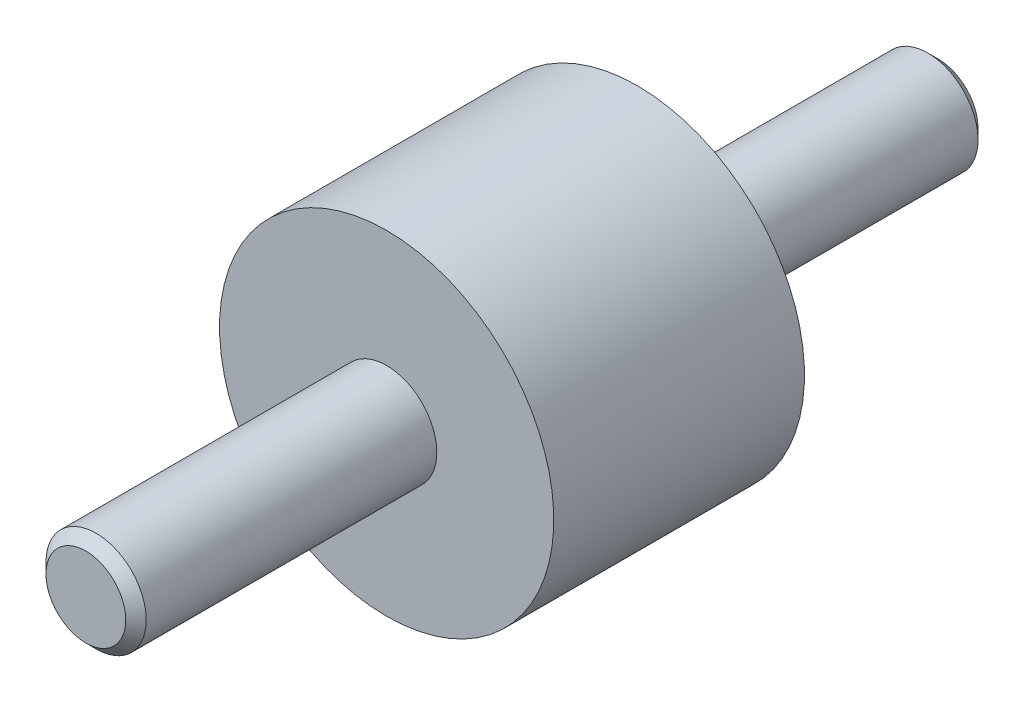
ISO-10303-21;
HEADER;
FILE_DESCRIPTION(('STEP AP214'),'2;1');
FILE_NAME('part.step','',(''),(''),'','','');
FILE_SCHEMA(('AUTOMOTIVE_DESIGN { 1 0 10303 214 1 1 1 1 }'));
ENDSEC;
DATA;
#1=APPLICATION_CONTEXT('core data for automotive mechanical design processes');
#2=APPLICATION_PROTOCOL_DEFINITION('international standard','automotive_design',2000,#1);
#3=PRODUCT_CONTEXT('',#1,'mechanical');
#4=PRODUCT('Part','Part','',(#3));
#5=PRODUCT_RELATED_PRODUCT_CATEGORY('part','',(#4));
#6=PRODUCT_DEFINITION_FORMATION('','',#4);
#7=PRODUCT_DEFINITION_CONTEXT('part definition',#1,'design');
#8=PRODUCT_DEFINITION('design','',#6,#7);
#9=PRODUCT_DEFINITION_SHAPE('','',#8);
#10=(LENGTH_UNIT() NAMED_UNIT(*) SI_UNIT(.MILLI.,.METRE.));
#11=(NAMED_UNIT(*) PLANE_ANGLE_UNIT() SI_UNIT($,.RADIAN.));
#12=(NAMED_UNIT(*) SI_UNIT($,.STERADIAN.) SOLID_ANGLE_UNIT());
#13=UNCERTAINTY_MEASURE_WITH_UNIT(LENGTH_MEASURE(1.E-05),#10,'distance_accuracy_value','');
#14=(GEOMETRIC_REPRESENTATION_CONTEXT(3) GLOBAL_UNCERTAINTY_ASSIGNED_CONTEXT((#13)) GLOBAL_UNIT_ASSIGNED_CONTEXT((#10,
#11,#12)) REPRESENTATION_CONTEXT('',''));
#15=CARTESIAN_POINT('',(0.,0.,0.));
#16=DIRECTION('',(0.,0.,1.));
#17=DIRECTION('',(1.,0.,0.));
#18=AXIS2_PLACEMENT_3D('',#15,#16,#17);
#19=CARTESIAN_POINT('',(9.3333333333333,0.,15.));
#20=DIRECTION('',(0.,0.,1.));
#21=DIRECTION('',(0.,-1.,0.));
#22=AXIS2_PLACEMENT_3D('',#19,#20,#21);
#23=PLANE('',#22);
#24=CARTESIAN_POINT('',(0.,0.,15.));
#25=DIRECTION('',(0.,0.,1.));
#26=DIRECTION('',(0.,-1.,0.));
#27=AXIS2_PLACEMENT_3D('',#24,#25,#26);
#28=CIRCLE('',#27,3.);
#29=CARTESIAN_POINT('',(0.,-3.,15.));
#30=VERTEX_POINT('',#29);
#31=EDGE_CURVE('E8',#30,#30,#28,.T.);
#32=ORIENTED_EDGE('',*,*,#31,.F.);
#33=EDGE_LOOP('',(#32));
#34=FACE_BOUND('',#33,.T.);
#35=CARTESIAN_POINT('',(0.,0.,15.));
#36=DIRECTION('',(0.,0.,1.));
#37=DIRECTION('',(0.,-1.,0.));
#38=AXIS2_PLACEMENT_3D('',#35,#36,#37);
#39=CIRCLE('',#38,10.);
#40=CARTESIAN_POINT('',(0.,-10.,15.));
#41=VERTEX_POINT('',#40);
#42=EDGE_CURVE('E22',#41,#41,#39,.T.);
#43=ORIENTED_EDGE('',*,*,#42,.T.);
#44=EDGE_LOOP('',(#43));
#45=FACE_BOUND('',#44,.T.);
#46=ADVANCED_FACE('F12',(#34,#45),#23,.T.);
#47=CARTESIAN_POINT('',(0.,0.,0.5));
#48=DIRECTION('',(0.,0.,1.));
#49=DIRECTION('',(0.,-1.,0.));
#50=AXIS2_PLACEMENT_3D('',#47,#48,#49);
#51=CYLINDRICAL_SURFACE('',#50,10.);
#52=CARTESIAN_POINT('',(0.,0.,0.));
#53=DIRECTION('',(0.,0.,1.));
#54=DIRECTION('',(0.,-1.,0.));
#55=AXIS2_PLACEMENT_3D('',#52,#53,#54);
#56=CIRCLE('',#55,10.);
#57=CARTESIAN_POINT('',(0.,-10.,0.));
#58=VERTEX_POINT('',#57);
#59=EDGE_CURVE('E26',#58,#58,#56,.T.);
#60=ORIENTED_EDGE('',*,*,#59,.T.);
#61=EDGE_LOOP('',(#60));
#62=FACE_BOUND('',#61,.T.);
#63=ORIENTED_EDGE('',*,*,#42,.F.);
#64=EDGE_LOOP('',(#63));
#65=FACE_BOUND('',#64,.T.);
#66=ADVANCED_FACE('F57',(#62,#65),#51,.T.);
#67=CARTESIAN_POINT('',(10.,0.,0.));
#68=DIRECTION('',(0.,0.,-1.));
#69=DIRECTION('',(0.,1.,0.));
#70=AXIS2_PLACEMENT_3D('',#67,#68,#69);
#71=PLANE('',#70);
#72=CARTESIAN_POINT('',(0.,0.,0.));
#73=DIRECTION('',(0.,0.,-1.));
#74=DIRECTION('',(0.,1.,0.));
#75=AXIS2_PLACEMENT_3D('',#72,#73,#74);
#76=CIRCLE('',#75,3.);
#77=CARTESIAN_POINT('',(0.,3.,0.));
#78=VERTEX_POINT('',#77);
#79=EDGE_CURVE('E18',#78,#78,#76,.T.);
#80=ORIENTED_EDGE('',*,*,#79,.F.);
#81=EDGE_LOOP('',(#80));
#82=FACE_BOUND('',#81,.T.);
#83=ORIENTED_EDGE('',*,*,#59,.F.);
#84=EDGE_LOOP('',(#83));
#85=FACE_BOUND('',#84,.T.);
#86=ADVANCED_FACE('F62',(#82,#85),#71,.T.);
#87=CARTESIAN_POINT('',(0.,0.,-18.));
#88=DIRECTION('',(0.,0.,1.));
#89=DIRECTION('',(0.,-1.,0.));
#90=AXIS2_PLACEMENT_3D('',#87,#88,#89);
#91=CYLINDRICAL_SURFACE('',#90,3.);
#92=CARTESIAN_POINT('',(0.,0.,-17.3865));
#93=DIRECTION('',(0.,0.,1.));
#94=DIRECTION('',(0.,-1.,0.));
#95=AXIS2_PLACEMENT_3D('',#92,#93,#94);
#96=CIRCLE('',#95,3.);
#97=CARTESIAN_POINT('',(0.,-3.,-17.3865));
#98=VERTEX_POINT('',#97);
#99=EDGE_CURVE('E31',#98,#98,#96,.T.);
#100=ORIENTED_EDGE('',*,*,#99,.T.);
#101=EDGE_LOOP('',(#100));
#102=FACE_BOUND('',#101,.T.);
#103=ORIENTED_EDGE('',*,*,#79,.T.);
#104=EDGE_LOOP('',(#103));
#105=FACE_BOUND('',#104,.T.);
#106=ADVANCED_FACE('F70',(#102,#105),#91,.T.);
#107=CARTESIAN_POINT('',(0.,0.,-17.3865));
#108=DIRECTION('',(0.,0.,1.));
#109=DIRECTION('',(0.,-1.,0.));
#110=AXIS2_PLACEMENT_3D('',#107,#108,#109);
#111=CONICAL_SURFACE('',#110,3.,0.785398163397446);
#112=CARTESIAN_POINT('',(0.,0.,-18.));
#113=DIRECTION('',(0.,0.,1.));
#114=DIRECTION('',(0.,-1.,0.));
#115=AXIS2_PLACEMENT_3D('',#112,#113,#114);
#116=CIRCLE('',#115,2.3865);
#117=CARTESIAN_POINT('',(0.,-2.3865,-18.));
#118=VERTEX_POINT('',#117);
#119=EDGE_CURVE('E34',#118,#118,#116,.T.);
#120=ORIENTED_EDGE('',*,*,#119,.T.);
#121=EDGE_LOOP('',(#120));
#122=FACE_BOUND('',#121,.T.);
#123=ORIENTED_EDGE('',*,*,#99,.F.);
#124=EDGE_LOOP('',(#123));
#125=FACE_BOUND('',#124,.T.);
#126=ADVANCED_FACE('F76',(#122,#125),#111,.T.);
#127=CARTESIAN_POINT('',(2.3865,0.,-18.));
#128=DIRECTION('',(0.,0.,-1.));
#129=DIRECTION('',(0.,1.,0.));
#130=AXIS2_PLACEMENT_3D('',#127,#128,#129);
#131=PLANE('',#130);
#132=ORIENTED_EDGE('',*,*,#119,.F.);
#133=EDGE_LOOP('',(#132));
#134=FACE_BOUND('',#133,.T.);
#135=ADVANCED_FACE('F80',(#134),#131,.T.);
#136=CARTESIAN_POINT('',(0.,0.,33.));
#137=DIRECTION('',(0.,0.,1.));
#138=DIRECTION('',(0.,-1.,0.));
#139=AXIS2_PLACEMENT_3D('',#136,#137,#138);
#140=PLANE('',#139);
#141=CARTESIAN_POINT('',(0.,0.,33.));
#142=DIRECTION('',(0.,0.,1.));
#143=DIRECTION('',(0.,-1.,0.));
#144=AXIS2_PLACEMENT_3D('',#141,#142,#143);
#145=CIRCLE('',#144,2.3865);
#146=CARTESIAN_POINT('',(0.,-2.3865,33.));
#147=VERTEX_POINT('',#146);
#148=EDGE_CURVE('E37',#147,#147,#145,.T.);
#149=ORIENTED_EDGE('',*,*,#148,.T.);
#150=EDGE_LOOP('',(#149));
#151=FACE_BOUND('',#150,.T.);
#152=ADVANCED_FACE('F54',(#151),#140,.T.);
#153=CARTESIAN_POINT('',(0.,0.,33.));
#154=DIRECTION('',(0.,0.,-1.));
#155=DIRECTION('',(0.,1.,0.));
#156=AXIS2_PLACEMENT_3D('',#153,#154,#155);
#157=CONICAL_SURFACE('',#156,2.3865,0.785398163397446);
#158=CARTESIAN_POINT('',(0.,0.,32.3865));
#159=DIRECTION('',(0.,0.,1.));
#160=DIRECTION('',(0.,-1.,0.));
#161=AXIS2_PLACEMENT_3D('',#158,#159,#160);
#162=CIRCLE('',#161,3.);
#163=CARTESIAN_POINT('',(0.,-3.,32.3865));
#164=VERTEX_POINT('',#163);
#165=EDGE_CURVE('E40',#164,#164,#162,.T.);
#166=ORIENTED_EDGE('',*,*,#165,.T.);
#167=EDGE_LOOP('',(#166));
#168=FACE_BOUND('',#167,.T.);
#169=ORIENTED_EDGE('',*,*,#148,.F.);
#170=EDGE_LOOP('',(#169));
#171=FACE_BOUND('',#170,.T.);
#172=ADVANCED_FACE('F44',(#168,#171),#157,.T.);
#173=CARTESIAN_POINT('',(0.,0.,15.));
#174=DIRECTION('',(0.,0.,1.));
#175=DIRECTION('',(0.,-1.,0.));
#176=AXIS2_PLACEMENT_3D('',#173,#174,#175);
#177=CYLINDRICAL_SURFACE('',#176,3.);
#178=ORIENTED_EDGE('',*,*,#31,.T.);
#179=EDGE_LOOP('',(#178));
#180=FACE_BOUND('',#179,.T.);
#181=ORIENTED_EDGE('',*,*,#165,.F.);
#182=EDGE_LOOP('',(#181));
#183=FACE_BOUND('',#182,.T.);
#184=ADVANCED_FACE('F47',(#180,#183),#177,.T.);
#185=CLOSED_SHELL('',(#46,#66,#86,#106,#126,#135,#152,#172,#184));
#186=MANIFOLD_SOLID_BREP('B1',#185);
#187=ADVANCED_BREP_SHAPE_REPRESENTATION('',(#18,#186),#14);
#188=SHAPE_DEFINITION_REPRESENTATION(#9,#187);
ENDSEC;
END-ISO-10303-21;
